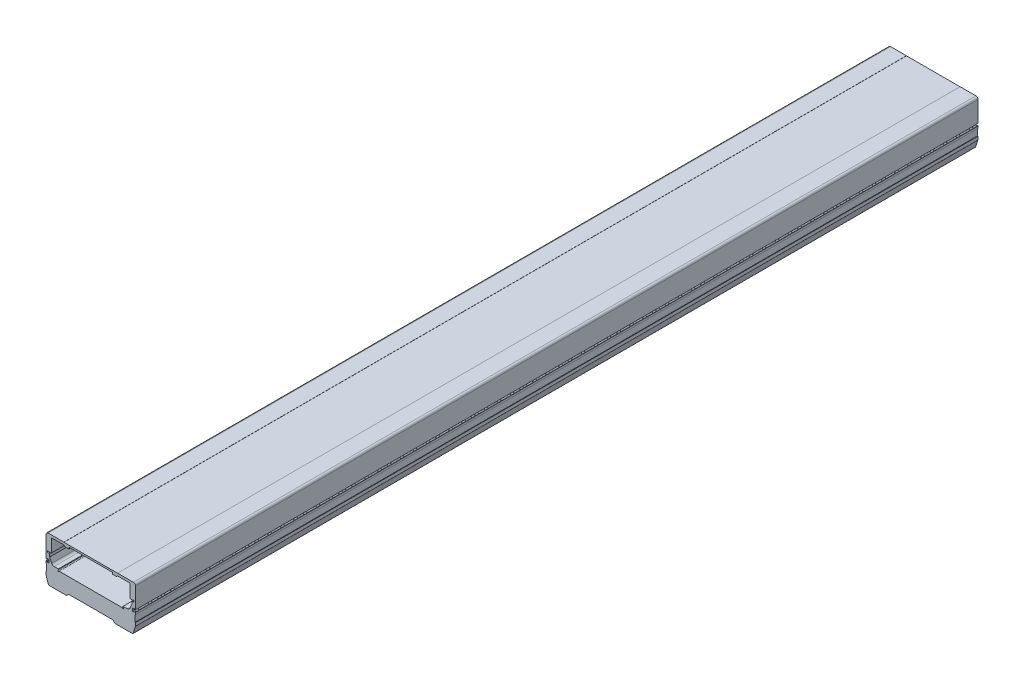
from build123d import *

# Parameters (mm, degrees)
EXTRUDE_1_DEPTH      = 1601
HOLE_WIZARD_M8_D     = 6.8
HOLE_WIZARD_M8_DEPTH = 19.75
HOLE_WIZARD_M8_TIP   = 2.042926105


with BuildPart() as part:
    # Sketch 1 → Extrude 1 (new body)
    with BuildSketch(Plane.XY):
        with BuildLine():
            Line((-85, 77.3), (-85, 37.9))
            ThreePointArc((-85, 37.9), (-84.912132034, 37.687867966), (-84.7, 37.6))
            Line((-84.7, 37.6), (-83.3, 37.6))
            ThreePointArc((-83.3, 37.6), (-83.087867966, 37.687867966), (-83, 37.9))
            Line((-83, 37.9), (-83, 38.4))
            ThreePointArc((-83, 38.4), (-82.912132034, 38.612132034), (-82.7, 38.7))
            Line((-82.7, 38.7), (-80.2, 38.7))
            ThreePointArc((-80.2, 38.7), (-79.492893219, 38.407106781), (-79.2, 37.7))
            Line((-79.2, 37.7), (-79.2, 33.9))
            ThreePointArc((-79.2, 33.9), (-79.492893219, 33.192893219), (-80.2, 32.9))
            Line((-80.2, 32.9), (-82.7, 32.9))
            ThreePointArc((-82.7, 32.9), (-82.912132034, 32.987867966), (-83, 33.2))
            Line((-83, 33.2), (-83, 33.7))
            ThreePointArc((-83, 33.7), (-83.087867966, 33.912132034), (-83.3, 34))
            Line((-83.3, 34), (-84.7, 34))
            ThreePointArc((-84.7, 34), (-84.912132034, 33.912132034), (-85, 33.7))
            Line((-85, 33.7), (-85, 29.8))
            Line((-85, 29.8), (-84.5, 29.3))
            Line((-84.5, 29.3), (-84.5, 17.3))
            Line((-84.5, 17.3), (-85, 16.8))
            Line((-85, 16.8), (-85, 10.86227766))
            ThreePointArc((-85, 10.86227766), (-84.987087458, 10.702095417), (-84.948683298, 10.546049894))
            Line((-84.948683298, 10.546049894), (-80.327924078, -3.316227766))
            ThreePointArc((-80.327924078, -3.316227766), (-79.963951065, -3.811242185), (-79.37924078, -4))
            Line((-79.37924078, -4), (-46, -4))
            Line((-46, -4), (-42, 0))
            Line((-42, 0), (42, 0))
            Line((42, 0), (46, -4))
            Line((46, -4), (79.37924078, -4))
            ThreePointArc((79.37924078, -4), (79.963951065, -3.811242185), (80.327924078, -3.316227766))
            Line((80.327924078, -3.316227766), (84.948683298, 10.546049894))
            ThreePointArc((84.948683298, 10.546049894), (84.987087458, 10.702095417), (85, 10.86227766))
            Line((85, 10.86227766), (85, 16.8))
            Line((85, 16.8), (84.5, 17.3))
            Line((84.5, 17.3), (84.5, 29.3))
            Line((84.5, 29.3), (85, 29.8))
            Line((85, 29.8), (85, 33.7))
            ThreePointArc((85, 33.7), (84.912132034, 33.912132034), (84.7, 34))
            Line((84.7, 34), (83.3, 34))
            ThreePointArc((83.3, 34), (83.087867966, 33.912132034), (83, 33.7))
            Line((83, 33.7), (83, 33.2))
            ThreePointArc((83, 33.2), (82.912132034, 32.987867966), (82.7, 32.9))
            Line((82.7, 32.9), (80.2, 32.9))
            ThreePointArc((80.2, 32.9), (79.492893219, 33.192893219), (79.2, 33.9))
            Line((79.2, 33.9), (79.2, 37.7))
            ThreePointArc((79.2, 37.7), (79.492893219, 38.407106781), (80.2, 38.7))
            Line((80.2, 38.7), (82.7, 38.7))
            ThreePointArc((82.7, 38.7), (82.912132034, 38.612132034), (83, 38.4))
            Line((83, 38.4), (83, 37.9))
            ThreePointArc((83, 37.9), (83.087867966, 37.687867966), (83.3, 37.6))
            Line((83.3, 37.6), (84.7, 37.6))
            ThreePointArc((84.7, 37.6), (84.912132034, 37.687867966), (85, 37.9))
            Line((85, 37.9), (85, 77.3))
            ThreePointArc((85, 77.3), (83.828427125, 80.128427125), (81, 81.3))
            Line((81, 81.3), (51, 81.3))
            Line((51, 81.3), (50.868986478, 81.168986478))
            Line((50.868986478, 81.168986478), (-50.868986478, 81.168986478))
            Line((-50.868986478, 81.168986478), (-51, 81.3))
            Line((-51, 81.3), (-81, 81.3))
            ThreePointArc((-81, 81.3), (-83.828427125, 80.128427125), (-85, 77.3))
        make_face()
        with BuildLine():
            Line((-41, 77.8), (-41, 75.1))
            ThreePointArc((-41, 75.1), (-41.087867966, 74.887867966), (-41.3, 74.8))
            Line((-41.3, 74.8), (-49, 74.8))
            Line((-49, 74.8), (-51, 76.8))
            Line((-51, 76.8), (-74, 76.8))
            ThreePointArc((-74, 76.8), (-74.707106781, 76.507106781), (-75, 75.8))
            Line((-75, 75.8), (-75, 51.3))
            Line((-75, 51.3), (-79.687559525, 51.3))
            ThreePointArc((-79.687559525, 51.3), (-82.65, 50.3), (-79.687559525, 49.3))
            Line((-79.687559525, 49.3), (-78.1, 49.3))
            Line((-78.1, 49.3), (-78.1, 43.3))
            Line((-78.1, 43.3), (-74.176911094, 34.886908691))
            ThreePointArc((-74.176911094, 34.886908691), (-72.331870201, 32.783042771), (-69.645372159, 32))
            Line((-69.645372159, 32), (-61.5, 32))
            Line((-61.5, 32), (-61.5, 30.414213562))
            Line((-61.5, 30.414213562), (-62.207106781, 29.707106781))
            ThreePointArc((-62.207106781, 29.707106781), (-62.207106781, 28.292893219), (-60.792893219, 28.292893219))
            Line((-60.792893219, 28.292893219), (-60.085786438, 29))
            Line((-60.085786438, 29), (60.085786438, 29))
            Line((60.085786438, 29), (60.792893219, 28.292893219))
            ThreePointArc((60.792893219, 28.292893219), (62.207106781, 28.292893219), (62.207106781, 29.707106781))
            Line((62.207106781, 29.707106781), (61.5, 30.414213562))
            Line((61.5, 30.414213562), (61.5, 32))
            Line((61.5, 32), (69.645372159, 32))
            ThreePointArc((69.645372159, 32), (72.331870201, 32.783042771), (74.176911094, 34.886908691))
            Line((74.176911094, 34.886908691), (78.1, 43.3))
            Line((78.1, 43.3), (78.1, 49.3))
            Line((78.1, 49.3), (79.687559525, 49.3))
            ThreePointArc((79.687559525, 49.3), (82.65, 50.3), (79.687559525, 51.3))
            Line((79.687559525, 51.3), (75, 51.3))
            Line((75, 51.3), (75, 75.8))
            ThreePointArc((75, 75.8), (74.707106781, 76.507106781), (74, 76.8))
            Line((74, 76.8), (51, 76.8))
            Line((51, 76.8), (49, 74.8))
            Line((49, 74.8), (41.3, 74.8))
            ThreePointArc((41.3, 74.8), (41.087867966, 74.887867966), (41, 75.1))
            Line((41, 75.1), (41, 77.8))
            Line((41, 77.8), (-41, 77.8))
        make_face(mode=Mode.SUBTRACT)
    extrude(amount=-EXTRUDE_1_DEPTH)

    # Hole Wizard M8
    with Locations(Plane(origin=(0, -4, 0), x_dir=(-1, 0, 0), z_dir=(0, -1, 0))):
        with Locations((70, 1542.5), (-70, 1542.5), (70, 1392.5), (-70, 1392.5), (-70, 1192.5), (70, 1192.5), (-70, 992.5), (70, 992.5), (-70, 792.5), (70, 792.5), (-70, 592.5), (70, 592.5), (70, 392.5), (-70, 392.5), (-70, 192.5), (-70, -7.5), (70, -7.5), (70, 192.5)):
            Hole(HOLE_WIZARD_M8_D / 2, depth=HOLE_WIZARD_M8_DEPTH)
            with Locations((0, 0, -(HOLE_WIZARD_M8_DEPTH + HOLE_WIZARD_M8_TIP / 2))):  # 118° drill point
                Cone(0, HOLE_WIZARD_M8_D / 2, HOLE_WIZARD_M8_TIP, mode=Mode.SUBTRACT)


solid = part.part
